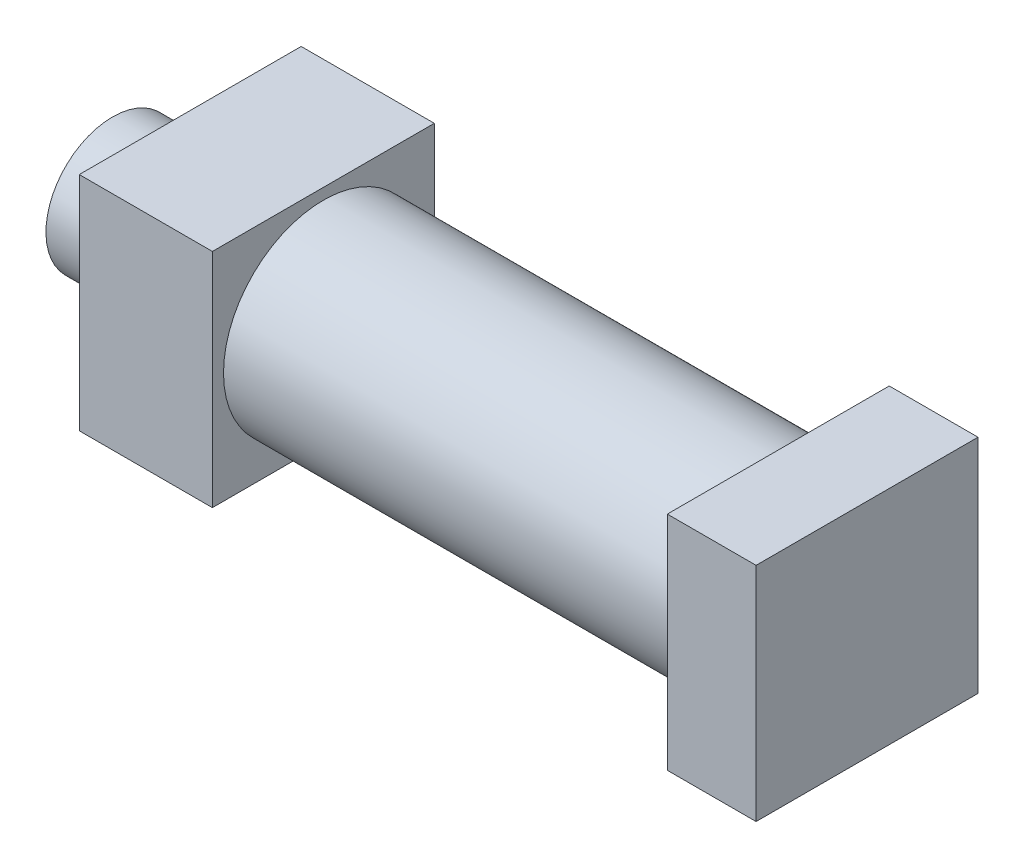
from build123d import *

# Parameters (mm, degrees)
SKETCH1_W                   = 63.5
SKETCH1_H                   = 63.5
BASE_EXTRUDE_DEPTH          = 25.4
SKETCH2_R                   = 28.575
SKETCH2_R_2                 = 25.4
BORE_DEPTH                  = 193.675
SKETCH3_W                   = 63.5
SKETCH3_H                   = 63.5
BOSS_EXTRUDE2_DEPTH         = 38.1
SKETCH4_R                   = 19.05
BOSS_EXTRUDE3_DEPTH         = 22.225
CUT_EXTRUDE1_REACH          = 222.52
SKETCH5_R                   = 12.7
SKETCH6_R                   = 3.96875
TAPPED_BASE_HOLES_MS4_DEPTH = 19.05


with BuildPart() as part:
    # Sketch1 → Base-Extrude (new body)
    with BuildSketch(Plane(origin=(0, 0, 0), x_dir=(0, 0, -1), z_dir=(1, 0, 0))):
        Rectangle(SKETCH1_W, SKETCH1_H)
    extrude(amount=-BASE_EXTRUDE_DEPTH)

    # Sketch2 → BORE (add)
    with BuildSketch(Plane.ZY):
        with Locations(Location((0, 0, 0), (0, 0, 270))):
            Circle(SKETCH2_R)
        with Locations(Location((0, 0, 0), (0, 0, 270))):
            Circle(SKETCH2_R_2, mode=Mode.SUBTRACT)
    extrude(amount=BORE_DEPTH)

    # Sketch3 → Boss-Extrude2 (add)
    with BuildSketch(Plane.ZY.offset(193.675)):
        Rectangle(SKETCH3_W, SKETCH3_H)
    extrude(amount=-BOSS_EXTRUDE2_DEPTH)

    # Sketch4 → Boss-Extrude3 (add)
    with BuildSketch(Plane(origin=(-193.675, 0, 0), x_dir=(0, 0, -1), z_dir=(1, 0, 0))):
        with Locations(Location((0, 0, 0), (0, 0, 90))):
            Circle(SKETCH4_R)
    extrude(amount=-BOSS_EXTRUDE3_DEPTH)

    # Sketch5 → Cut-Extrude1 (cut, up to next)
    with BuildSketch(Plane.ZY.offset(215.9), mode=Mode.PRIVATE) as cut_extrude1_sk1:
        with Locations(Location((0, 0, 0), (0, 0, 270))):
            Circle(SKETCH5_R)
    cut_extrude1_tool1 = extrude(cut_extrude1_sk1.sketch, amount=-CUT_EXTRUDE1_REACH, mode=Mode.PRIVATE) & part.part
    add(cut_extrude1_tool1.solids().sort_by_distance((-215.9, 0, 0))[0], mode=Mode.SUBTRACT)

    # Sketch6 → TAPPED BASE HOLES - MS4 (cut)
    with BuildSketch(Plane(origin=(148.541814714, -31.75, 0.813855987), x_dir=(1, 0, 0), z_dir=(0, -1, 0))):
        with Locations(Location((-161.241814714, 10.298644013, 0), (0, 0, 270))):
            Circle(SKETCH6_R)
        with Locations(Location((-161.241814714, -11.926355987, 0), (0, 0, 270))):
            Circle(SKETCH6_R)
        with Locations(Location((-323.166814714, -11.926355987, 0), (0, 0, 270))):
            Circle(SKETCH6_R)
        with Locations(Location((-323.166814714, 10.298644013, 0), (0, 0, 270))):
            Circle(SKETCH6_R)
    extrude(amount=-TAPPED_BASE_HOLES_MS4_DEPTH, mode=Mode.SUBTRACT)


solid = part.part
